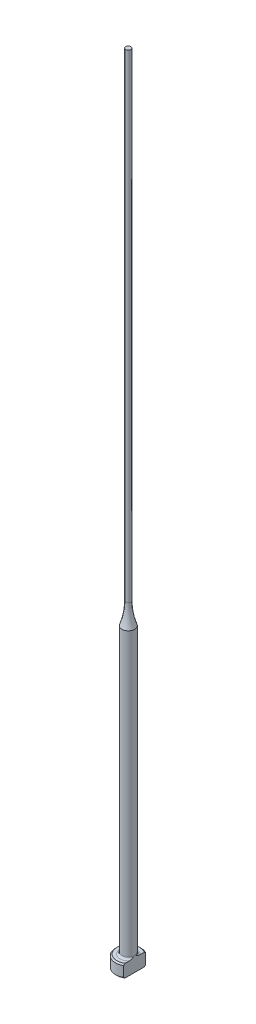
from build123d import *
from build123d.topology import SkipClean

# Parameters (mm, degrees)
CHAMFER1_SIZE = 0.2
FILLET1_R     = 0.3
KEY_DEPTH     = 126.031995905


with BuildPart() as part:
    # Sketch1 → Revolve1 (revolve)
    with BuildSketch(Plane.XY, mode=Mode.PRIVATE) as revolve1_sk:
        with BuildLine():
            Line((0, 0), (-2, 0))
            Line((-2, 0), (-2, 2))
            Line((-2, 2), (-1, 2))
            Line((-1, 2), (-1, 46.588255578))
            ThreePointArc((-1, 46.588255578), (-0.551142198, 48.267949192), (-0.4, 50))
            Line((-0.4, 50), (-0.4, 125))
            Line((-0.4, 125), (0, 125))
            Line((0, 125), (0, 0))
        make_face()
    revolve(revolve1_sk.sketch.rotate(Axis((0, 259.958771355, 0), (0, -1, 0)), 270), axis=Axis((0, 259.958771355, 0), (0, -1, 0)))

    # Chamfer1
    chamfer1_edges = [part.edges().sort_by_distance(p)[0] for p in [
        (0, 0, -2),
        (0, 2, -2),
    ]]
    chamfer(chamfer1_edges, length=CHAMFER1_SIZE)

    # Fillet1
    fillet1_edges = [part.edges().sort_by_distance(p)[0] for p in [
        (0, 2, -1),
    ]]
    fillet(fillet1_edges, radius=FILLET1_R)

    # Sketch2 → KEY (cut, through all)
    with SkipClean():  # the faces are left unmerged after this step: merging them gives an invalid solid
        with BuildSketch(Plane(origin=(0, 0, 0), x_dir=(1, 0, 0), z_dir=(0, 1, 0))):
            with BuildLine():
                Line((1, 1.732050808), (1, -1.732050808))
                ThreePointArc((1, -1.732050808), (2, 0), (1, 1.732050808))
            make_face()
        extrude(amount=KEY_DEPTH, mode=Mode.SUBTRACT)


solid = part.part
